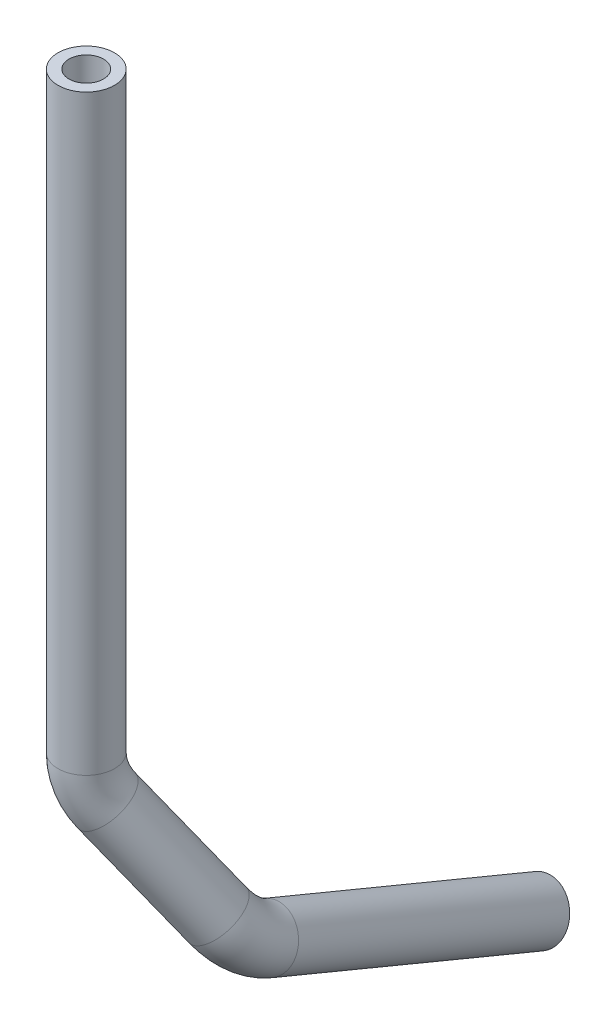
from build123d import *

# Parameters (mm, degrees)
SKETCH1_R   = 7.9375
SKETCH1_R_2 = 4.8641


with BuildPart() as part:
    # Sweep1: sweep along a curve in space
    with BuildLine() as sweep1_path:
        Line((0, 0, 0), (0, -166.397905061, 0))
        ThreePointArc((2.88300891, -178.203353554, -2.913701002), (0.741256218, -172.646305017, -0.749147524), (0, -166.397905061, 0))
        Line((18.406115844, -206.15417107, -18.602064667), (2.88300891, -178.203353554, -2.913701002))
        ThreePointArc((18.406115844, -206.15417107, -18.602064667), (20.950550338, -211.520085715, -23.067345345), (21.844, -215.362758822, -29.363497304))
        Line((21.844, -215.362758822, -29.363497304), (21.844, -246.94071635, -105.599430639))
    # Sketch1 → Sweep1 (sweep)
    with BuildSketch(Plane(origin=(0, 0, 0), x_dir=(1, 0, 0), z_dir=(0, 1, 0))):
        Circle(SKETCH1_R)
        Circle(SKETCH1_R_2, mode=Mode.SUBTRACT)
    sweep(path=sweep1_path.line)


solid = part.part
